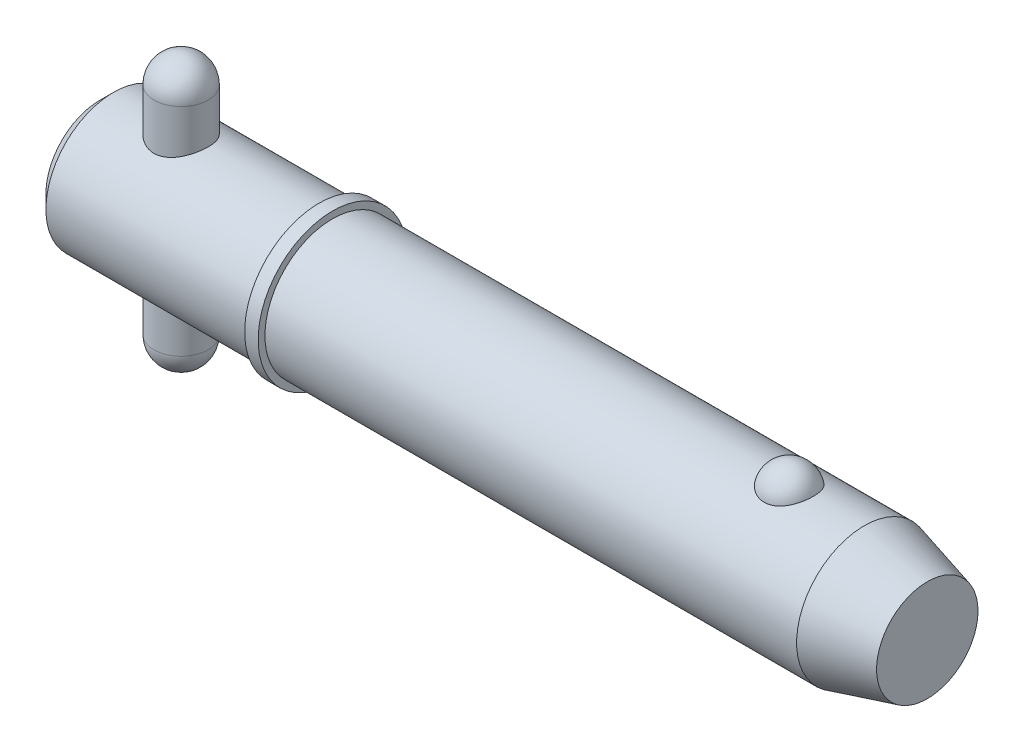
ISO-10303-21;
HEADER;
FILE_DESCRIPTION(('STEP AP214'),'2;1');
FILE_NAME('part.step','',(''),(''),'','','');
FILE_SCHEMA(('AUTOMOTIVE_DESIGN { 1 0 10303 214 1 1 1 1 }'));
ENDSEC;
DATA;
#1=APPLICATION_CONTEXT('core data for automotive mechanical design processes');
#2=APPLICATION_PROTOCOL_DEFINITION('international standard','automotive_design',2000,#1);
#3=PRODUCT_CONTEXT('',#1,'mechanical');
#4=PRODUCT('Part','Part','',(#3));
#5=PRODUCT_RELATED_PRODUCT_CATEGORY('part','',(#4));
#6=PRODUCT_DEFINITION_FORMATION('','',#4);
#7=PRODUCT_DEFINITION_CONTEXT('part definition',#1,'design');
#8=PRODUCT_DEFINITION('design','',#6,#7);
#9=PRODUCT_DEFINITION_SHAPE('','',#8);
#10=(LENGTH_UNIT() NAMED_UNIT(*) SI_UNIT(.MILLI.,.METRE.));
#11=(NAMED_UNIT(*) PLANE_ANGLE_UNIT() SI_UNIT($,.RADIAN.));
#12=(NAMED_UNIT(*) SI_UNIT($,.STERADIAN.) SOLID_ANGLE_UNIT());
#13=UNCERTAINTY_MEASURE_WITH_UNIT(LENGTH_MEASURE(1.E-05),#10,'distance_accuracy_value','');
#14=(GEOMETRIC_REPRESENTATION_CONTEXT(3) GLOBAL_UNCERTAINTY_ASSIGNED_CONTEXT((#13)) GLOBAL_UNIT_ASSIGNED_CONTEXT((#10,
#11,#12)) REPRESENTATION_CONTEXT('',''));
#15=CARTESIAN_POINT('',(0.,0.,0.));
#16=DIRECTION('',(0.,0.,1.));
#17=DIRECTION('',(1.,0.,0.));
#18=AXIS2_PLACEMENT_3D('',#15,#16,#17);
#19=CARTESIAN_POINT('',(9.525,15.875,0.));
#20=DIRECTION('',(0.,-1.,0.));
#21=DIRECTION('',(0.,0.,-1.));
#22=AXIS2_PLACEMENT_3D('',#19,#20,#21);
#23=CYLINDRICAL_SURFACE('',#22,3.175);
#24=CARTESIAN_POINT('',(9.525,-12.7,0.));
#25=DIRECTION('',(0.,-1.,0.));
#26=DIRECTION('',(0.,0.,-1.));
#27=AXIS2_PLACEMENT_3D('',#24,#25,#26);
#28=CIRCLE('',#27,3.175);
#29=CARTESIAN_POINT('',(9.525,-12.7,-3.175));
#30=VERTEX_POINT('',#29);
#31=EDGE_CURVE('P0_E10',#30,#30,#28,.F.);
#32=ORIENTED_EDGE('',*,*,#31,.T.);
#33=EDGE_LOOP('',(#32));
#34=FACE_BOUND('',#33,.T.);
#35=CARTESIAN_POINT('',(9.525,12.7,0.));
#36=DIRECTION('',(0.,-1.,0.));
#37=DIRECTION('',(0.,0.,-1.));
#38=AXIS2_PLACEMENT_3D('',#35,#36,#37);
#39=CIRCLE('',#38,3.175);
#40=CARTESIAN_POINT('',(9.525,12.7,-3.175));
#41=VERTEX_POINT('',#40);
#42=EDGE_CURVE('P0_E21',#41,#41,#39,.T.);
#43=ORIENTED_EDGE('',*,*,#42,.T.);
#44=EDGE_LOOP('',(#43));
#45=FACE_BOUND('',#44,.T.);
#46=ADVANCED_FACE('P0_F14',(#34,#45),#23,.T.);
#47=CARTESIAN_POINT('',(9.525,-12.7,0.));
#48=DIRECTION('',(0.,0.,1.));
#49=DIRECTION('',(1.,0.,0.));
#50=AXIS2_PLACEMENT_3D('',#47,#48,#49);
#51=SPHERICAL_SURFACE('',#50,3.175);
#52=CARTESIAN_POINT('',(9.525,-12.7,0.));
#53=DIRECTION('',(0.,-1.,0.));
#54=DIRECTION('',(0.,0.,-1.));
#55=AXIS2_PLACEMENT_3D('',#52,#53,#54);
#56=SPHERICAL_SURFACE('',#55,3.175);
#57=ORIENTED_EDGE('',*,*,#31,.F.);
#58=EDGE_LOOP('',(#57));
#59=FACE_BOUND('',#58,.T.);
#60=ADVANCED_FACE('P0_F29',(#59),#56,.T.);
#61=CARTESIAN_POINT('',(9.525,12.7,0.));
#62=DIRECTION('',(0.,0.,1.));
#63=DIRECTION('',(1.,0.,0.));
#64=AXIS2_PLACEMENT_3D('',#61,#62,#63);
#65=SPHERICAL_SURFACE('',#64,3.175);
#66=CARTESIAN_POINT('',(9.525,12.7,0.));
#67=DIRECTION('',(0.,-1.,0.));
#68=DIRECTION('',(0.,0.,-1.));
#69=AXIS2_PLACEMENT_3D('',#66,#67,#68);
#70=SPHERICAL_SURFACE('',#69,3.175);
#71=ORIENTED_EDGE('',*,*,#42,.F.);
#72=EDGE_LOOP('',(#71));
#73=FACE_BOUND('',#72,.T.);
#74=ADVANCED_FACE('P0_F16',(#73),#70,.T.);
#75=CLOSED_SHELL('',(#46,#60,#74));
#76=MANIFOLD_SOLID_BREP('P0_B1',#75);
#77=CARTESIAN_POINT('',(0.,0.,0.));
#78=DIRECTION('',(1.,0.,0.));
#79=DIRECTION('',(0.,0.,-1.));
#80=AXIS2_PLACEMENT_3D('',#77,#78,#79);
#81=CYLINDRICAL_SURFACE('',#80,7.94);
#82=CARTESIAN_POINT('',(89.7518791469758,0.,0.));
#83=DIRECTION('',(1.,0.,0.));
#84=DIRECTION('',(0.,0.,-1.));
#85=AXIS2_PLACEMENT_3D('',#82,#83,#84);
#86=CIRCLE('',#85,7.94);
#87=CARTESIAN_POINT('',(89.7518791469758,0.,-7.94));
#88=VERTEX_POINT('',#87);
#89=EDGE_CURVE('P1_E81',#88,#88,#86,.T.);
#90=ORIENTED_EDGE('',*,*,#89,.F.);
#91=EDGE_LOOP('',(#90));
#92=FACE_BOUND('',#91,.T.);
#93=CARTESIAN_POINT('',(27.31,0.,0.));
#94=DIRECTION('',(1.,0.,0.));
#95=DIRECTION('',(0.,0.,-1.));
#96=AXIS2_PLACEMENT_3D('',#93,#94,#95);
#97=CIRCLE('',#96,7.94);
#98=CARTESIAN_POINT('',(27.31,0.,-7.94));
#99=VERTEX_POINT('',#98);
#100=EDGE_CURVE('P1_E85',#99,#99,#97,.T.);
#101=ORIENTED_EDGE('',*,*,#100,.T.);
#102=EDGE_LOOP('',(#101));
#103=FACE_BOUND('',#102,.T.);
#104=CARTESIAN_POINT('',(80.9449074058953,7.37767842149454,2.93486986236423));
#105=CARTESIAN_POINT('',(80.7927496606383,7.3776732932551,2.93487505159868));
#106=CARTESIAN_POINT('',(80.6406329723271,7.38258419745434,2.92262454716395));
#107=CARTESIAN_POINT('',(80.3409284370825,7.40163229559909,2.87404196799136));
#108=CARTESIAN_POINT('',(80.1933394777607,7.41576720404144,2.83771585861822));
#109=CARTESIAN_POINT('',(79.9070187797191,7.4516157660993,2.74218769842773));
#110=CARTESIAN_POINT('',(79.7682745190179,7.47331841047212,2.68301886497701));
#111=CARTESIAN_POINT('',(79.5028822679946,7.52194082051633,2.54350967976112));
#112=CARTESIAN_POINT('',(79.3762366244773,7.5488615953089,2.46316523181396));
#113=CARTESIAN_POINT('',(79.1345349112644,7.60594671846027,2.28090375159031));
#114=CARTESIAN_POINT('',(79.0199065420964,7.63618114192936,2.17844211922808));
#115=CARTESIAN_POINT('',(78.8088787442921,7.69614046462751,1.95608495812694));
#116=CARTESIAN_POINT('',(78.7124826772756,7.72586526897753,1.83618622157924));
#117=CARTESIAN_POINT('',(78.5359381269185,7.78314821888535,1.57628086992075));
#118=CARTESIAN_POINT('',(78.4567072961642,7.81055035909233,1.43561546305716));
#119=CARTESIAN_POINT('',(78.3217979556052,7.85879631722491,1.14236334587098));
#120=CARTESIAN_POINT('',(78.2661216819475,7.87963951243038,0.989775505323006));
#121=CARTESIAN_POINT('',(78.1788121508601,7.91289645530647,0.67461992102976));
#122=CARTESIAN_POINT('',(78.1475309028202,7.925186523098,0.511941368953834));
#123=CARTESIAN_POINT('',(78.110975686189,7.93958930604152,0.183247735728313));
#124=CARTESIAN_POINT('',(78.1057012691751,7.94170219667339,0.0172327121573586));
#125=CARTESIAN_POINT('',(78.1212311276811,7.93554931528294,-0.312672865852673));
#126=CARTESIAN_POINT('',(78.1419253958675,7.92732732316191,-0.476569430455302));
#127=CARTESIAN_POINT('',(78.2087865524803,7.90141534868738,-0.798305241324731));
#128=CARTESIAN_POINT('',(78.2549539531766,7.88372517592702,-0.956144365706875));
#129=CARTESIAN_POINT('',(78.3718986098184,7.84066230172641,-1.26152073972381));
#130=CARTESIAN_POINT('',(78.4427046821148,7.81528060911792,-1.40904568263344));
#131=CARTESIAN_POINT('',(78.6074789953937,7.7594867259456,-1.68950598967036));
#132=CARTESIAN_POINT('',(78.7014488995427,7.72907417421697,-1.82244030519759));
#133=CARTESIAN_POINT('',(78.9108391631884,7.66640424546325,-2.07032792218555));
#134=CARTESIAN_POINT('',(79.0263152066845,7.63414223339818,-2.1852330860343));
#135=CARTESIAN_POINT('',(79.2759006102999,7.57149681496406,-2.39329737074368));
#136=CARTESIAN_POINT('',(79.4100080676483,7.54111321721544,-2.48645870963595));
#137=CARTESIAN_POINT('',(79.6901113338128,7.48650742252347,-2.64628132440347));
#138=CARTESIAN_POINT('',(79.8357605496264,7.46215900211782,-2.71350554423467));
#139=CARTESIAN_POINT('',(80.1374259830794,7.42171253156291,-2.82226614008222));
#140=CARTESIAN_POINT('',(80.2934383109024,7.40561140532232,-2.86381209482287));
#141=CARTESIAN_POINT('',(80.6029708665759,7.3842679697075,-2.91839077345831));
#142=CARTESIAN_POINT('',(80.7562229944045,7.37852109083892,-2.93275024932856));
#143=CARTESIAN_POINT('',(81.0630705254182,7.37700973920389,-2.93655208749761));
#144=CARTESIAN_POINT('',(81.2166658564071,7.38124333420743,-2.92599927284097));
#145=CARTESIAN_POINT('',(81.5149907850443,7.39890635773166,-2.88102897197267));
#146=CARTESIAN_POINT('',(81.6598480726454,7.41205491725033,-2.8473399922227));
#147=CARTESIAN_POINT('',(81.9416432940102,7.445801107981,-2.75788206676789));
#148=CARTESIAN_POINT('',(82.0785805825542,7.46639934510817,-2.70211132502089));
#149=CARTESIAN_POINT('',(82.3440619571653,7.51339098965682,-2.56858908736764));
#150=CARTESIAN_POINT('',(82.4723548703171,7.53990200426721,-2.49038067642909));
#151=CARTESIAN_POINT('',(82.7142440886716,7.59569503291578,-2.31462737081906));
#152=CARTESIAN_POINT('',(82.8278370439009,7.62497767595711,-2.21707808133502));
#153=CARTESIAN_POINT('',(83.04322156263,7.68489473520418,-1.99982049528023));
#154=CARTESIAN_POINT('',(83.1441488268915,7.71552419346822,-1.87925337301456));
#155=CARTESIAN_POINT('',(83.3251866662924,7.77353016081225,-1.62268826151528));
#156=CARTESIAN_POINT('',(83.4052934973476,7.80090608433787,-1.4866875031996));
#157=CARTESIAN_POINT('',(83.5453615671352,7.85047992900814,-1.19818413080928));
#158=CARTESIAN_POINT('',(83.6045877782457,7.8724818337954,-1.04529016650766));
#159=CARTESIAN_POINT('',(83.6979821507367,7.90785114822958,-0.731080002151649));
#160=CARTESIAN_POINT('',(83.7321497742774,7.92121837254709,-0.569763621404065));
#161=CARTESIAN_POINT('',(83.774795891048,7.93797834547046,-0.242812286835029));
#162=CARTESIAN_POINT('',(83.7832047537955,7.94134405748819,-0.0771668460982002));
#163=CARTESIAN_POINT('',(83.7739626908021,7.93767937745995,0.2532769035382));
#164=CARTESIAN_POINT('',(83.7563120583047,7.93064910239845,0.418075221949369));
#165=CARTESIAN_POINT('',(83.6954247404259,7.90695571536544,0.741525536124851));
#166=CARTESIAN_POINT('',(83.6522819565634,7.8903279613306,0.900197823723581));
#167=CARTESIAN_POINT('',(83.5413535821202,7.84916386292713,1.20759654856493));
#168=CARTESIAN_POINT('',(83.47356656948,7.82462706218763,1.35632241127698));
#169=CARTESIAN_POINT('',(83.3143718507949,7.7700669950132,1.64032869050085));
#170=CARTESIAN_POINT('',(83.2228616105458,7.7400200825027,1.77554712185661));
#171=CARTESIAN_POINT('',(83.0182960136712,7.67774175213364,2.02800648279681));
#172=CARTESIAN_POINT('',(82.9052410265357,7.64551037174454,2.14524772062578));
#173=CARTESIAN_POINT('',(82.6608318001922,7.58265895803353,2.35778002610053));
#174=CARTESIAN_POINT('',(82.5295833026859,7.5520309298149,2.45319004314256));
#175=CARTESIAN_POINT('',(82.251601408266,7.49579792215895,2.61999897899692));
#176=CARTESIAN_POINT('',(82.1048670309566,7.47019326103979,2.69139637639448));
#177=CARTESIAN_POINT('',(81.7929477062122,7.42622216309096,2.8105324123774));
#178=CARTESIAN_POINT('',(81.6272209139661,7.40825002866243,2.85700910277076));
#179=CARTESIAN_POINT('',(81.2892792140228,7.38398348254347,2.9191685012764));
#180=CARTESIAN_POINT('',(81.1170670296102,7.3776842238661,2.93486399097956));
#181=CARTESIAN_POINT('',(80.9449074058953,7.37767842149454,2.93486986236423));
#182=B_SPLINE_CURVE_WITH_KNOTS('',3,(#104,#105,#106,#107,#108,#109,#110,#111,#112,#113,#114,
#115,#116,#117,#118,#119,#120,#121,#122,#123,#124,#125,#126,#127,#128,#129,#130,#131,#132,#133,
#134,#135,#136,#137,#138,#139,#140,#141,#142,#143,#144,#145,#146,#147,#148,#149,#150,#151,#152,
#153,#154,#155,#156,#157,#158,#159,#160,#161,#162,#163,#164,#165,#166,#167,#168,#169,#170,#171,
#172,#173,#174,#175,#176,#177,#178,#179,#180,#181),.UNSPECIFIED.,.T.,.F.,(4,2,2,2,2,2,2,2,2,2,2,
2,2,2,2,2,2,2,2,2,2,2,2,2,2,2,2,2,2,2,2,2,2,2,2,2,2,2,4),(0.,0.45584132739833,0.911569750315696,
1.36663794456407,1.8217942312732,2.28978983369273,2.7578716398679,3.246853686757,
3.73588214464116,4.23184282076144,4.72779494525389,5.22165321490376,5.71552141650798,
6.20996917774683,6.70445245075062,7.20023431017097,7.69596557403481,8.18023418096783,
8.66432203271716,9.12410697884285,9.58380291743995,10.0296503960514,10.4755341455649,
10.9312349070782,11.3870393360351,11.8654416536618,12.3439299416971,12.8378875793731,
13.3318558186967,13.8271581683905,14.3224549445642,14.8159385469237,15.3094506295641,
15.8051323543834,16.3008055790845,16.7937101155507,17.2866458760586,17.8026240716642,
18.3183879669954),.UNSPECIFIED.);
#183=CARTESIAN_POINT('',(80.9449074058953,7.37767842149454,2.93486986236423));
#184=VERTEX_POINT('',#183);
#185=EDGE_CURVE('P1_E35',#184,#184,#182,.T.);
#186=ORIENTED_EDGE('',*,*,#185,.T.);
#187=EDGE_LOOP('',(#186));
#188=FACE_BOUND('',#187,.T.);
#189=ADVANCED_FACE('P1_F13',(#92,#103,#188),#81,.T.);
#190=CARTESIAN_POINT('',(0.,0.,0.));
#191=DIRECTION('',(-1.,0.,0.));
#192=DIRECTION('',(0.,0.,1.));
#193=AXIS2_PLACEMENT_3D('',#190,#191,#192);
#194=PLANE('',#193);
#195=CARTESIAN_POINT('',(0.,0.,0.));
#196=DIRECTION('',(1.,0.,0.));
#197=DIRECTION('',(0.,0.,-1.));
#198=AXIS2_PLACEMENT_3D('',#195,#196,#197);
#199=CIRCLE('',#198,6.352);
#200=CARTESIAN_POINT('',(0.,0.,-6.352));
#201=VERTEX_POINT('',#200);
#202=EDGE_CURVE('P1_E9',#201,#201,#199,.T.);
#203=ORIENTED_EDGE('',*,*,#202,.F.);
#204=EDGE_LOOP('',(#203));
#205=FACE_BOUND('',#204,.T.);
#206=ADVANCED_FACE('P1_F15',(#205),#194,.T.);
#207=CARTESIAN_POINT('',(1.58799999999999,0.,0.));
#208=DIRECTION('',(1.,0.,0.));
#209=DIRECTION('',(0.,0.,-1.));
#210=AXIS2_PLACEMENT_3D('',#207,#208,#209);
#211=CONICAL_SURFACE('',#210,7.94,0.78539816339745);
#212=ORIENTED_EDGE('',*,*,#202,.T.);
#213=EDGE_LOOP('',(#212));
#214=FACE_BOUND('',#213,.T.);
#215=CARTESIAN_POINT('',(1.58799999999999,0.,0.));
#216=DIRECTION('',(1.,0.,0.));
#217=DIRECTION('',(0.,0.,-1.));
#218=AXIS2_PLACEMENT_3D('',#215,#216,#217);
#219=CIRCLE('',#218,7.94);
#220=CARTESIAN_POINT('',(1.58799999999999,0.,-7.94));
#221=VERTEX_POINT('',#220);
#222=EDGE_CURVE('P1_E26',#221,#221,#219,.T.);
#223=ORIENTED_EDGE('',*,*,#222,.F.);
#224=EDGE_LOOP('',(#223));
#225=FACE_BOUND('',#224,.T.);
#226=ADVANCED_FACE('P1_F77',(#214,#225),#211,.T.);
#227=CARTESIAN_POINT('',(0.,0.,0.));
#228=DIRECTION('',(1.,0.,0.));
#229=DIRECTION('',(0.,0.,-1.));
#230=AXIS2_PLACEMENT_3D('',#227,#228,#229);
#231=CYLINDRICAL_SURFACE('',#230,7.94);
#232=CARTESIAN_POINT('',(9.525,-7.27756655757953,3.175));
#233=CARTESIAN_POINT('',(9.43992346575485,-7.27756715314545,3.17499935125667));
#234=CARTESIAN_POINT('',(9.35481882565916,-7.27906496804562,3.1715736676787));
#235=CARTESIAN_POINT('',(9.18524505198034,-7.28499816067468,3.15791803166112));
#236=CARTESIAN_POINT('',(9.100776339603,-7.28943533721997,3.14768391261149));
#237=CARTESIAN_POINT('',(8.84895715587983,-7.30698881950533,3.10684226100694));
#238=CARTESIAN_POINT('',(8.6834173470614,-7.32434654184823,3.06609574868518));
#239=CARTESIAN_POINT('',(8.36278910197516,-7.36806950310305,2.95945910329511));
#240=CARTESIAN_POINT('',(8.20766386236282,-7.39440078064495,2.89366366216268));
#241=CARTESIAN_POINT('',(7.91065319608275,-7.45304562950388,2.73907413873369));
#242=CARTESIAN_POINT('',(7.76876488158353,-7.48535789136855,2.65028508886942));
#243=CARTESIAN_POINT('',(7.49411086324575,-7.55439482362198,2.44679888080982));
#244=CARTESIAN_POINT('',(7.36219910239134,-7.59126138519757,2.33099745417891));
#245=CARTESIAN_POINT('',(7.11904234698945,-7.66408045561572,2.07909838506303));
#246=CARTESIAN_POINT('',(7.00780457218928,-7.70003264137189,1.94299368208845));
#247=CARTESIAN_POINT('',(6.80492173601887,-7.76867514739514,1.64775981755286));
#248=CARTESIAN_POINT('',(6.71422139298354,-7.80118112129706,1.48793473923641));
#249=CARTESIAN_POINT('',(6.56135788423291,-7.85754918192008,1.15376269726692));
#250=CARTESIAN_POINT('',(6.49918311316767,-7.88141478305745,0.979421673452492));
#251=CARTESIAN_POINT('',(6.40818142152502,-7.91680873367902,0.630115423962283));
#252=CARTESIAN_POINT('',(6.3778864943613,-7.9288781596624,0.455588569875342));
#253=CARTESIAN_POINT('',(6.34677743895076,-7.94127547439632,0.103539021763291));
#254=CARTESIAN_POINT('',(6.34595232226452,-7.94160773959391,-0.0739825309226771));
#255=CARTESIAN_POINT('',(6.37300128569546,-7.93082261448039,-0.416371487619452));
#256=CARTESIAN_POINT('',(6.39926693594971,-7.92034690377,-0.581389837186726));
#257=CARTESIAN_POINT('',(6.47701615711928,-7.88998770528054,-0.904449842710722));
#258=CARTESIAN_POINT('',(6.52850157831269,-7.87010352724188,-1.06249098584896));
#259=CARTESIAN_POINT('',(6.65586120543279,-7.82249343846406,-1.36995769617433));
#260=CARTESIAN_POINT('',(6.73209124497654,-7.79465387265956,-1.51921754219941));
#261=CARTESIAN_POINT('',(6.90644286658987,-7.73389606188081,-1.80321183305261));
#262=CARTESIAN_POINT('',(7.00457194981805,-7.70097607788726,-1.93794127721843));
#263=CARTESIAN_POINT('',(7.22744086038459,-7.63084889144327,-2.19843606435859));
#264=CARTESIAN_POINT('',(7.35350432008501,-7.59350211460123,-2.3230330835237));
#265=CARTESIAN_POINT('',(7.62488266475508,-7.52039654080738,-2.54979642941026));
#266=CARTESIAN_POINT('',(7.77020381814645,-7.48463826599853,-2.65195542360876));
#267=CARTESIAN_POINT('',(8.08119298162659,-7.41780943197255,-2.83361305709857));
#268=CARTESIAN_POINT('',(8.24731937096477,-7.38689959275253,-2.91239105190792));
#269=CARTESIAN_POINT('',(8.59204539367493,-7.33515216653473,-3.04038913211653));
#270=CARTESIAN_POINT('',(8.77063684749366,-7.31430804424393,-3.08962840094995));
#271=CARTESIAN_POINT('',(9.12356982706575,-7.28663831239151,-3.15431018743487));
#272=CARTESIAN_POINT('',(9.29750494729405,-7.2790344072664,-3.17163284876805));
#273=CARTESIAN_POINT('',(9.64592502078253,-7.27648884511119,-3.17747282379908));
#274=CARTESIAN_POINT('',(9.82040979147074,-7.28154335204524,-3.16599886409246));
#275=CARTESIAN_POINT('',(10.1545374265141,-7.30294638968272,-3.11628310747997));
#276=CARTESIAN_POINT('',(10.3144598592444,-7.31863587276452,-3.0796016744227));
#277=CARTESIAN_POINT('',(10.625774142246,-7.35872371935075,-2.98253618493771));
#278=CARTESIAN_POINT('',(10.7771640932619,-7.38312401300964,-2.92214687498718));
#279=CARTESIAN_POINT('',(11.0739599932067,-7.4390944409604,-2.77664664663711));
#280=CARTESIAN_POINT('',(11.2188745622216,-7.47091513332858,-2.69063278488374));
#281=CARTESIAN_POINT('',(11.4928722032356,-7.53775867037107,-2.49724834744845));
#282=CARTESIAN_POINT('',(11.6219487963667,-7.57278281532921,-2.38986907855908));
#283=CARTESIAN_POINT('',(11.8705091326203,-7.64520845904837,-2.1474449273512));
#284=CARTESIAN_POINT('',(11.9885816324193,-7.68259462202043,-2.01094304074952));
#285=CARTESIAN_POINT('',(12.2003631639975,-7.75309951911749,-1.71917041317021));
#286=CARTESIAN_POINT('',(12.2940712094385,-7.78621808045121,-1.56389891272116));
#287=CARTESIAN_POINT('',(12.4541161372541,-7.84456050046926,-1.23845027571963));
#288=CARTESIAN_POINT('',(12.5204600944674,-7.86978639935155,-1.06827700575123));
#289=CARTESIAN_POINT('',(12.6231407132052,-7.90943635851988,-0.717928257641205));
#290=CARTESIAN_POINT('',(12.6594936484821,-7.92386627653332,-0.537758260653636));
#291=CARTESIAN_POINT('',(12.6992281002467,-7.93967263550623,-0.185201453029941));
#292=CARTESIAN_POINT('',(12.7046050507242,-7.94183891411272,-0.0130732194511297));
#293=CARTESIAN_POINT('',(12.6875036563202,-7.9350072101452,0.329549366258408));
#294=CARTESIAN_POINT('',(12.6650295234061,-7.92601091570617,0.500043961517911));
#295=CARTESIAN_POINT('',(12.5942896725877,-7.89825976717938,0.829196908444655));
#296=CARTESIAN_POINT('',(12.5468364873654,-7.87981280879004,0.988057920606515));
#297=CARTESIAN_POINT('',(12.4283390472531,-7.83513565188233,1.29553461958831));
#298=CARTESIAN_POINT('',(12.3572904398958,-7.8089040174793,1.44414841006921));
#299=CARTESIAN_POINT('',(12.1900822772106,-7.7497911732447,1.73412879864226));
#300=CARTESIAN_POINT('',(12.0929519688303,-7.71666737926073,1.87488510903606));
#301=CARTESIAN_POINT('',(11.8777894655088,-7.64775894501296,2.13869231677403));
#302=CARTESIAN_POINT('',(11.7597486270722,-7.61197320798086,2.26173585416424));
#303=CARTESIAN_POINT('',(11.4974896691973,-7.53902341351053,2.49449755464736));
#304=CARTESIAN_POINT('',(11.3521039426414,-7.50191102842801,2.60292060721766));
#305=CARTESIAN_POINT('',(11.0440201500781,-7.43289551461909,2.79392602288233));
#306=CARTESIAN_POINT('',(10.8813200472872,-7.40099299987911,2.87650534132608));
#307=CARTESIAN_POINT('',(10.558064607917,-7.3489506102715,3.00682739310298));
#308=CARTESIAN_POINT('',(10.398627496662,-7.32801197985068,3.05703164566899));
#309=CARTESIAN_POINT('',(10.0731242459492,-7.29639491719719,3.13175843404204));
#310=CARTESIAN_POINT('',(9.90707793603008,-7.28568789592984,3.15635254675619));
#311=CARTESIAN_POINT('',(9.70441566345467,-7.27968826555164,3.17013149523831));
#312=CARTESIAN_POINT('',(9.66856669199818,-7.27889378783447,3.17195593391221));
#313=CARTESIAN_POINT('',(9.59681348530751,-7.27783278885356,3.17439036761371));
#314=CARTESIAN_POINT('',(9.56090924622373,-7.27756630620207,3.17500027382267));
#315=CARTESIAN_POINT('',(9.525,-7.27756655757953,3.175));
#316=B_SPLINE_CURVE_WITH_KNOTS('',3,(#232,#233,#234,#235,#236,#237,#238,#239,#240,#241,#242,
#243,#244,#245,#246,#247,#248,#249,#250,#251,#252,#253,#254,#255,#256,#257,#258,#259,#260,#261,
#262,#263,#264,#265,#266,#267,#268,#269,#270,#271,#272,#273,#274,#275,#276,#277,#278,#279,#280,
#281,#282,#283,#284,#285,#286,#287,#288,#289,#290,#291,#292,#293,#294,#295,#296,#297,#298,#299,
#300,#301,#302,#303,#304,#305,#306,#307,#308,#309,#310,#311,#312,#313,#314,#315),.UNSPECIFIED.,
.T.,.F.,(4,2,2,2,2,2,2,2,2,2,2,2,2,2,2,2,2,2,2,2,2,2,2,2,2,2,2,2,2,2,2,2,2,2,2,2,2,2,2,2,2,4),
(0.,0.255187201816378,0.510530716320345,1.0218798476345,1.53131482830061,2.04063840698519,
2.57635929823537,3.11226692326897,3.66929090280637,4.22608806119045,4.75594400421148,
5.28560237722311,5.78552836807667,6.28549104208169,6.79298787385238,7.30065880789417,
7.8416422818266,8.38280228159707,8.93923025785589,9.49529647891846,10.0174074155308,
10.5393601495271,11.0316114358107,11.5239718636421,12.0362920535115,12.5488211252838,
13.0991799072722,13.6495609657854,14.1997996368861,14.7497395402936,15.2638187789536,
15.7778202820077,16.2760504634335,16.7743726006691,17.294711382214,17.8152657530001,
18.3680208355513,18.9208410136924,19.4240423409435,19.9258334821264,20.0335354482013,
20.1412452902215),.UNSPECIFIED.);
#317=CARTESIAN_POINT('',(9.525,-7.27756655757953,3.175));
#318=VERTEX_POINT('',#317);
#319=EDGE_CURVE('P1_E17',#318,#318,#316,.T.);
#320=ORIENTED_EDGE('',*,*,#319,.F.);
#321=EDGE_LOOP('',(#320));
#322=FACE_BOUND('',#321,.T.);
#323=CARTESIAN_POINT('',(9.525,7.27756655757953,3.175));
#324=CARTESIAN_POINT('',(9.61007653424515,7.27756715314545,3.17499935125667));
#325=CARTESIAN_POINT('',(9.69518117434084,7.27906496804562,3.1715736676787));
#326=CARTESIAN_POINT('',(9.86475494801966,7.28499816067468,3.15791803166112));
#327=CARTESIAN_POINT('',(9.949223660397,7.28943533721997,3.14768391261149));
#328=CARTESIAN_POINT('',(10.2010428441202,7.30698881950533,3.10684226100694));
#329=CARTESIAN_POINT('',(10.3665826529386,7.32434654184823,3.06609574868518));
#330=CARTESIAN_POINT('',(10.6872108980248,7.36806950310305,2.95945910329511));
#331=CARTESIAN_POINT('',(10.8423361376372,7.39440078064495,2.89366366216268));
#332=CARTESIAN_POINT('',(11.1393468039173,7.45304562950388,2.73907413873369));
#333=CARTESIAN_POINT('',(11.2812351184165,7.48535789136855,2.65028508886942));
#334=CARTESIAN_POINT('',(11.5558891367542,7.55439482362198,2.44679888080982));
#335=CARTESIAN_POINT('',(11.6878008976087,7.59126138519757,2.33099745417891));
#336=CARTESIAN_POINT('',(11.9309576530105,7.66408045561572,2.07909838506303));
#337=CARTESIAN_POINT('',(12.0421954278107,7.70003264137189,1.94299368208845));
#338=CARTESIAN_POINT('',(12.2450782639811,7.76867514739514,1.64775981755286));
#339=CARTESIAN_POINT('',(12.3357786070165,7.80118112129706,1.48793473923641));
#340=CARTESIAN_POINT('',(12.4886421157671,7.85754918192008,1.15376269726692));
#341=CARTESIAN_POINT('',(12.5508168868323,7.88141478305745,0.979421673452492));
#342=CARTESIAN_POINT('',(12.641818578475,7.91680873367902,0.630115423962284));
#343=CARTESIAN_POINT('',(12.6721135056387,7.9288781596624,0.455588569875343));
#344=CARTESIAN_POINT('',(12.7032225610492,7.94127547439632,0.103539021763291));
#345=CARTESIAN_POINT('',(12.7040476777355,7.94160773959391,-0.0739825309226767));
#346=CARTESIAN_POINT('',(12.6769987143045,7.93082261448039,-0.416371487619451));
#347=CARTESIAN_POINT('',(12.6507330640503,7.92034690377,-0.581389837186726));
#348=CARTESIAN_POINT('',(12.5729838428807,7.88998770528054,-0.904449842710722));
#349=CARTESIAN_POINT('',(12.5214984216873,7.87010352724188,-1.06249098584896));
#350=CARTESIAN_POINT('',(12.3941387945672,7.82249343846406,-1.36995769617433));
#351=CARTESIAN_POINT('',(12.3179087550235,7.79465387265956,-1.51921754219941));
#352=CARTESIAN_POINT('',(12.1435571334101,7.73389606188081,-1.80321183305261));
#353=CARTESIAN_POINT('',(12.0454280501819,7.70097607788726,-1.93794127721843));
#354=CARTESIAN_POINT('',(11.8225591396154,7.63084889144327,-2.19843606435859));
#355=CARTESIAN_POINT('',(11.696495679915,7.59350211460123,-2.3230330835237));
#356=CARTESIAN_POINT('',(11.4251173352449,7.52039654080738,-2.54979642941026));
#357=CARTESIAN_POINT('',(11.2797961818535,7.48463826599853,-2.65195542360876));
#358=CARTESIAN_POINT('',(10.9688070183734,7.41780943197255,-2.83361305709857));
#359=CARTESIAN_POINT('',(10.8026806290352,7.38689959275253,-2.91239105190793));
#360=CARTESIAN_POINT('',(10.4579546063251,7.33515216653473,-3.04038913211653));
#361=CARTESIAN_POINT('',(10.2793631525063,7.31430804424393,-3.08962840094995));
#362=CARTESIAN_POINT('',(9.92643017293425,7.28663831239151,-3.15431018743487));
#363=CARTESIAN_POINT('',(9.75249505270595,7.2790344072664,-3.17163284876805));
#364=CARTESIAN_POINT('',(9.40407497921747,7.2764888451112,-3.17747282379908));
#365=CARTESIAN_POINT('',(9.22959020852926,7.28154335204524,-3.16599886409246));
#366=CARTESIAN_POINT('',(8.89546257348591,7.30294638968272,-3.11628310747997));
#367=CARTESIAN_POINT('',(8.73554014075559,7.31863587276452,-3.0796016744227));
#368=CARTESIAN_POINT('',(8.42422585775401,7.35872371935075,-2.98253618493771));
#369=CARTESIAN_POINT('',(8.27283590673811,7.38312401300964,-2.92214687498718));
#370=CARTESIAN_POINT('',(7.97604000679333,7.4390944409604,-2.77664664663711));
#371=CARTESIAN_POINT('',(7.83112543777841,7.47091513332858,-2.69063278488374));
#372=CARTESIAN_POINT('',(7.55712779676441,7.53775867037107,-2.49724834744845));
#373=CARTESIAN_POINT('',(7.42805120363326,7.57278281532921,-2.38986907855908));
#374=CARTESIAN_POINT('',(7.17949086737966,7.64520845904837,-2.1474449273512));
#375=CARTESIAN_POINT('',(7.06141836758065,7.68259462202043,-2.01094304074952));
#376=CARTESIAN_POINT('',(6.8496368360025,7.75309951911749,-1.71917041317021));
#377=CARTESIAN_POINT('',(6.75592879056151,7.78621808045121,-1.56389891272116));
#378=CARTESIAN_POINT('',(6.59588386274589,7.84456050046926,-1.23845027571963));
#379=CARTESIAN_POINT('',(6.52953990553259,7.86978639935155,-1.06827700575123));
#380=CARTESIAN_POINT('',(6.42685928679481,7.90943635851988,-0.717928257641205));
#381=CARTESIAN_POINT('',(6.39050635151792,7.92386627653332,-0.537758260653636));
#382=CARTESIAN_POINT('',(6.35077189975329,7.93967263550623,-0.18520145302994));
#383=CARTESIAN_POINT('',(6.34539494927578,7.94183891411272,-0.0130732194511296));
#384=CARTESIAN_POINT('',(6.36249634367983,7.9350072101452,0.329549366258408));
#385=CARTESIAN_POINT('',(6.38497047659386,7.92601091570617,0.500043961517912));
#386=CARTESIAN_POINT('',(6.45571032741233,7.89825976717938,0.829196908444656));
#387=CARTESIAN_POINT('',(6.50316351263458,7.87981280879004,0.988057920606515));
#388=CARTESIAN_POINT('',(6.62166095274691,7.83513565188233,1.29553461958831));
#389=CARTESIAN_POINT('',(6.69270956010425,7.8089040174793,1.44414841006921));
#390=CARTESIAN_POINT('',(6.85991772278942,7.7497911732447,1.73412879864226));
#391=CARTESIAN_POINT('',(6.95704803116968,7.71666737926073,1.87488510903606));
#392=CARTESIAN_POINT('',(7.17221053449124,7.64775894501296,2.13869231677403));
#393=CARTESIAN_POINT('',(7.29025137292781,7.61197320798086,2.26173585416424));
#394=CARTESIAN_POINT('',(7.55251033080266,7.53902341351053,2.49449755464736));
#395=CARTESIAN_POINT('',(7.69789605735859,7.50191102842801,2.60292060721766));
#396=CARTESIAN_POINT('',(8.00597984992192,7.43289551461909,2.79392602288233));
#397=CARTESIAN_POINT('',(8.16867995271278,7.40099299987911,2.87650534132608));
#398=CARTESIAN_POINT('',(8.49193539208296,7.3489506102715,3.00682739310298));
#399=CARTESIAN_POINT('',(8.65137250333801,7.32801197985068,3.05703164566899));
#400=CARTESIAN_POINT('',(8.97687575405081,7.29639491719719,3.13175843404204));
#401=CARTESIAN_POINT('',(9.14292206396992,7.28568789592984,3.15635254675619));
#402=CARTESIAN_POINT('',(9.34558433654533,7.27968826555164,3.17013149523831));
#403=CARTESIAN_POINT('',(9.38143330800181,7.27889378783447,3.17195593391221));
#404=CARTESIAN_POINT('',(9.45318651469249,7.27783278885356,3.17439036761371));
#405=CARTESIAN_POINT('',(9.48909075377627,7.27756630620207,3.17500027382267));
#406=CARTESIAN_POINT('',(9.525,7.27756655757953,3.175));
#407=B_SPLINE_CURVE_WITH_KNOTS('',3,(#323,#324,#325,#326,#327,#328,#329,#330,#331,#332,#333,
#334,#335,#336,#337,#338,#339,#340,#341,#342,#343,#344,#345,#346,#347,#348,#349,#350,#351,#352,
#353,#354,#355,#356,#357,#358,#359,#360,#361,#362,#363,#364,#365,#366,#367,#368,#369,#370,#371,
#372,#373,#374,#375,#376,#377,#378,#379,#380,#381,#382,#383,#384,#385,#386,#387,#388,#389,#390,
#391,#392,#393,#394,#395,#396,#397,#398,#399,#400,#401,#402,#403,#404,#405,#406),.UNSPECIFIED.,
.T.,.F.,(4,2,2,2,2,2,2,2,2,2,2,2,2,2,2,2,2,2,2,2,2,2,2,2,2,2,2,2,2,2,2,2,2,2,2,2,2,2,2,2,2,4),
(0.,0.255187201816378,0.510530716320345,1.0218798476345,1.53131482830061,2.04063840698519,
2.57635929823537,3.11226692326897,3.66929090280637,4.22608806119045,4.75594400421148,
5.2856023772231,5.78552836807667,6.28549104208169,6.79298787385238,7.30065880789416,
7.8416422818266,8.38280228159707,8.9392302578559,9.49529647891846,10.0174074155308,
10.5393601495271,11.0316114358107,11.5239718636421,12.0362920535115,12.5488211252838,
13.0991799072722,13.6495609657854,14.1997996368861,14.7497395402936,15.2638187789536,
15.7778202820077,16.2760504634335,16.7743726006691,17.294711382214,17.8152657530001,
18.3680208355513,18.9208410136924,19.4240423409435,19.9258334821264,20.0335354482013,
20.1412452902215),.UNSPECIFIED.);
#408=CARTESIAN_POINT('',(9.525,7.27756655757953,3.175));
#409=VERTEX_POINT('',#408);
#410=EDGE_CURVE('P1_E43',#409,#409,#407,.T.);
#411=ORIENTED_EDGE('',*,*,#410,.F.);
#412=EDGE_LOOP('',(#411));
#413=FACE_BOUND('',#412,.T.);
#414=ORIENTED_EDGE('',*,*,#222,.T.);
#415=EDGE_LOOP('',(#414));
#416=FACE_BOUND('',#415,.T.);
#417=CARTESIAN_POINT('',(25.722,0.,0.));
#418=DIRECTION('',(1.,0.,0.));
#419=DIRECTION('',(0.,0.,-1.));
#420=AXIS2_PLACEMENT_3D('',#417,#418,#419);
#421=CIRCLE('',#420,7.94);
#422=CARTESIAN_POINT('',(25.722,0.,-7.94));
#423=VERTEX_POINT('',#422);
#424=EDGE_CURVE('P1_E31',#423,#423,#421,.T.);
#425=ORIENTED_EDGE('',*,*,#424,.F.);
#426=EDGE_LOOP('',(#425));
#427=FACE_BOUND('',#426,.T.);
#428=ADVANCED_FACE('P1_F103',(#322,#413,#416,#427),#231,.T.);
#429=CARTESIAN_POINT('',(25.722,7.94,0.));
#430=DIRECTION('',(-1.,0.,0.));
#431=DIRECTION('',(0.,0.,1.));
#432=AXIS2_PLACEMENT_3D('',#429,#430,#431);
#433=PLANE('',#432);
#434=ORIENTED_EDGE('',*,*,#424,.T.);
#435=EDGE_LOOP('',(#434));
#436=FACE_BOUND('',#435,.T.);
#437=CARTESIAN_POINT('',(25.722,0.,0.));
#438=DIRECTION('',(1.,0.,0.));
#439=DIRECTION('',(0.,0.,-1.));
#440=AXIS2_PLACEMENT_3D('',#437,#438,#439);
#441=CIRCLE('',#440,8.734);
#442=CARTESIAN_POINT('',(25.722,0.,-8.734));
#443=VERTEX_POINT('',#442);
#444=EDGE_CURVE('P1_E91',#443,#443,#441,.T.);
#445=ORIENTED_EDGE('',*,*,#444,.F.);
#446=EDGE_LOOP('',(#445));
#447=FACE_BOUND('',#446,.T.);
#448=ADVANCED_FACE('P1_F100',(#436,#447),#433,.T.);
#449=CARTESIAN_POINT('',(0.,0.,0.));
#450=DIRECTION('',(1.,0.,0.));
#451=DIRECTION('',(0.,0.,-1.));
#452=AXIS2_PLACEMENT_3D('',#449,#450,#451);
#453=CYLINDRICAL_SURFACE('',#452,8.734);
#454=ORIENTED_EDGE('',*,*,#444,.T.);
#455=EDGE_LOOP('',(#454));
#456=FACE_BOUND('',#455,.T.);
#457=CARTESIAN_POINT('',(27.31,0.,0.));
#458=DIRECTION('',(1.,0.,0.));
#459=DIRECTION('',(0.,0.,-1.));
#460=AXIS2_PLACEMENT_3D('',#457,#458,#459);
#461=CIRCLE('',#460,8.734);
#462=CARTESIAN_POINT('',(27.31,0.,-8.734));
#463=VERTEX_POINT('',#462);
#464=EDGE_CURVE('P1_E88',#463,#463,#461,.T.);
#465=ORIENTED_EDGE('',*,*,#464,.F.);
#466=EDGE_LOOP('',(#465));
#467=FACE_BOUND('',#466,.T.);
#468=ADVANCED_FACE('P1_F68',(#456,#467),#453,.T.);
#469=CARTESIAN_POINT('',(27.31,8.734,0.));
#470=DIRECTION('',(1.,0.,0.));
#471=DIRECTION('',(0.,0.,-1.));
#472=AXIS2_PLACEMENT_3D('',#469,#470,#471);
#473=PLANE('',#472);
#474=ORIENTED_EDGE('',*,*,#464,.T.);
#475=EDGE_LOOP('',(#474));
#476=FACE_BOUND('',#475,.T.);
#477=ORIENTED_EDGE('',*,*,#100,.F.);
#478=EDGE_LOOP('',(#477));
#479=FACE_BOUND('',#478,.T.);
#480=ADVANCED_FACE('P1_F62',(#476,#479),#473,.T.);
#481=CARTESIAN_POINT('',(97.16,0.,0.));
#482=DIRECTION('',(-1.,0.,0.));
#483=DIRECTION('',(0.,0.,1.));
#484=AXIS2_PLACEMENT_3D('',#481,#482,#483);
#485=CONICAL_SURFACE('',#484,5.95500000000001,0.26179938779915);
#486=ORIENTED_EDGE('',*,*,#89,.T.);
#487=EDGE_LOOP('',(#486));
#488=FACE_BOUND('',#487,.T.);
#489=CARTESIAN_POINT('',(97.16,0.,0.));
#490=DIRECTION('',(1.,0.,0.));
#491=DIRECTION('',(0.,0.,-1.));
#492=AXIS2_PLACEMENT_3D('',#489,#490,#491);
#493=CIRCLE('',#492,5.95500000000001);
#494=CARTESIAN_POINT('',(97.16,0.,-5.95500000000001));
#495=VERTEX_POINT('',#494);
#496=EDGE_CURVE('P1_E42',#495,#495,#493,.T.);
#497=ORIENTED_EDGE('',*,*,#496,.F.);
#498=EDGE_LOOP('',(#497));
#499=FACE_BOUND('',#498,.T.);
#500=ADVANCED_FACE('P1_F59',(#488,#499),#485,.T.);
#501=CARTESIAN_POINT('',(97.16,5.95500000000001,0.));
#502=DIRECTION('',(1.,0.,0.));
#503=DIRECTION('',(0.,0.,-1.));
#504=AXIS2_PLACEMENT_3D('',#501,#502,#503);
#505=PLANE('',#504);
#506=ORIENTED_EDGE('',*,*,#496,.T.);
#507=EDGE_LOOP('',(#506));
#508=FACE_BOUND('',#507,.T.);
#509=ADVANCED_FACE('P1_F55',(#508),#505,.T.);
#510=CARTESIAN_POINT('',(80.9449074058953,7.146,0.));
#511=DIRECTION('',(-1.,0.,0.));
#512=DIRECTION('',(0.,1.,0.));
#513=AXIS2_PLACEMENT_3D('',#510,#511,#512);
#514=SPHERICAL_SURFACE('',#513,2.944);
#515=ORIENTED_EDGE('',*,*,#185,.F.);
#516=EDGE_LOOP('',(#515));
#517=FACE_BOUND('',#516,.T.);
#518=ADVANCED_FACE('P1_F50',(#517),#514,.T.);
#519=CARTESIAN_POINT('',(9.525,-8.734,0.));
#520=DIRECTION('',(0.,1.,0.));
#521=DIRECTION('',(0.,0.,1.));
#522=AXIS2_PLACEMENT_3D('',#519,#520,#521);
#523=CYLINDRICAL_SURFACE('',#522,3.175);
#524=ORIENTED_EDGE('',*,*,#319,.T.);
#525=EDGE_LOOP('',(#524));
#526=FACE_BOUND('',#525,.T.);
#527=ORIENTED_EDGE('',*,*,#410,.T.);
#528=EDGE_LOOP('',(#527));
#529=FACE_BOUND('',#528,.T.);
#530=ADVANCED_FACE('P1_F54',(#526,#529),#523,.F.);
#531=CLOSED_SHELL('',(#189,#206,#226,#428,#448,#468,#480,#500,#509,#518,#530));
#532=MANIFOLD_SOLID_BREP('P1_B1',#531);
#533=ADVANCED_BREP_SHAPE_REPRESENTATION('',(#18,#76,#532),#14);
#534=SHAPE_DEFINITION_REPRESENTATION(#9,#533);
ENDSEC;
END-ISO-10303-21;
